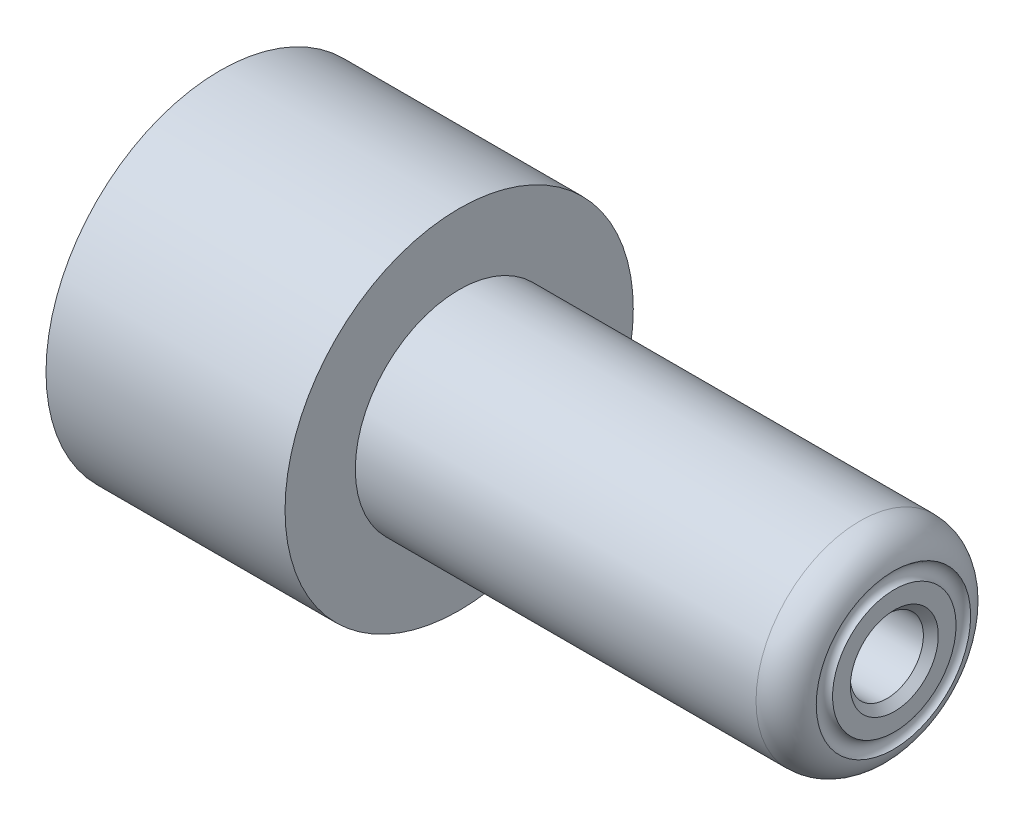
ISO-10303-21;
HEADER;
FILE_DESCRIPTION(('STEP AP214'),'2;1');
FILE_NAME('part.step','',(''),(''),'','','');
FILE_SCHEMA(('AUTOMOTIVE_DESIGN { 1 0 10303 214 1 1 1 1 }'));
ENDSEC;
DATA;
#1=APPLICATION_CONTEXT('core data for automotive mechanical design processes');
#2=APPLICATION_PROTOCOL_DEFINITION('international standard','automotive_design',2000,#1);
#3=PRODUCT_CONTEXT('',#1,'mechanical');
#4=PRODUCT('Part','Part','',(#3));
#5=PRODUCT_RELATED_PRODUCT_CATEGORY('part','',(#4));
#6=PRODUCT_DEFINITION_FORMATION('','',#4);
#7=PRODUCT_DEFINITION_CONTEXT('part definition',#1,'design');
#8=PRODUCT_DEFINITION('design','',#6,#7);
#9=PRODUCT_DEFINITION_SHAPE('','',#8);
#10=(LENGTH_UNIT() NAMED_UNIT(*) SI_UNIT(.MILLI.,.METRE.));
#11=(NAMED_UNIT(*) PLANE_ANGLE_UNIT() SI_UNIT($,.RADIAN.));
#12=(NAMED_UNIT(*) SI_UNIT($,.STERADIAN.) SOLID_ANGLE_UNIT());
#13=UNCERTAINTY_MEASURE_WITH_UNIT(LENGTH_MEASURE(1.E-05),#10,'distance_accuracy_value','');
#14=(GEOMETRIC_REPRESENTATION_CONTEXT(3) GLOBAL_UNCERTAINTY_ASSIGNED_CONTEXT((#13)) GLOBAL_UNIT_ASSIGNED_CONTEXT((#10,
#11,#12)) REPRESENTATION_CONTEXT('',''));
#15=CARTESIAN_POINT('',(0.,0.,0.));
#16=DIRECTION('',(0.,0.,1.));
#17=DIRECTION('',(1.,0.,0.));
#18=AXIS2_PLACEMENT_3D('',#15,#16,#17);
#19=CARTESIAN_POINT('',(30.734,3.165,0.));
#20=DIRECTION('',(-1.,0.,0.));
#21=DIRECTION('',(0.,0.,1.));
#22=AXIS2_PLACEMENT_3D('',#19,#20,#21);
#23=PLANE('',#22);
#24=CARTESIAN_POINT('',(30.734,0.,0.));
#25=DIRECTION('',(-1.,0.,0.));
#26=DIRECTION('',(0.,0.,1.));
#27=AXIS2_PLACEMENT_3D('',#24,#25,#26);
#28=CIRCLE('',#27,2.005);
#29=CARTESIAN_POINT('',(30.734,0.,2.005));
#30=VERTEX_POINT('',#29);
#31=EDGE_CURVE('E10',#30,#30,#28,.T.);
#32=ORIENTED_EDGE('',*,*,#31,.T.);
#33=EDGE_LOOP('',(#32));
#34=FACE_BOUND('',#33,.T.);
#35=CARTESIAN_POINT('',(30.734,0.,0.));
#36=DIRECTION('',(1.,0.,0.));
#37=DIRECTION('',(0.,0.,-1.));
#38=AXIS2_PLACEMENT_3D('',#35,#36,#37);
#39=CIRCLE('',#38,2.8144004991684);
#40=CARTESIAN_POINT('',(30.734,0.,-2.8144004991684));
#41=VERTEX_POINT('',#40);
#42=EDGE_CURVE('E78',#41,#41,#39,.F.);
#43=ORIENTED_EDGE('',*,*,#42,.F.);
#44=EDGE_LOOP('',(#43));
#45=FACE_BOUND('',#44,.T.);
#46=ADVANCED_FACE('F31',(#34,#45),#23,.F.);
#47=CARTESIAN_POINT('',(29.164,0.,0.));
#48=DIRECTION('',(-1.,0.,0.));
#49=DIRECTION('',(0.,0.,1.));
#50=AXIS2_PLACEMENT_3D('',#47,#48,#49);
#51=TOROIDAL_SURFACE('',#50,3.165,1.57);
#52=CARTESIAN_POINT('',(29.164,0.,0.));
#53=DIRECTION('',(-1.,0.,0.));
#54=DIRECTION('',(0.,0.,1.));
#55=AXIS2_PLACEMENT_3D('',#52,#53,#54);
#56=CIRCLE('',#55,4.735);
#57=CARTESIAN_POINT('',(29.164,0.,4.735));
#58=VERTEX_POINT('',#57);
#59=EDGE_CURVE('E48',#58,#58,#56,.T.);
#60=ORIENTED_EDGE('',*,*,#59,.F.);
#61=EDGE_LOOP('',(#60));
#62=FACE_BOUND('',#61,.T.);
#63=CARTESIAN_POINT('',(30.6935348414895,0.,0.));
#64=DIRECTION('',(1.,0.,0.));
#65=DIRECTION('',(0.,0.,-1.));
#66=AXIS2_PLACEMENT_3D('',#63,#64,#65);
#67=CIRCLE('',#66,3.51915133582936);
#68=CARTESIAN_POINT('',(30.6935348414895,0.,-3.51915133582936));
#69=VERTEX_POINT('',#68);
#70=EDGE_CURVE('E35',#69,#69,#67,.T.);
#71=ORIENTED_EDGE('',*,*,#70,.F.);
#72=EDGE_LOOP('',(#71));
#73=FACE_BOUND('',#72,.T.);
#74=ADVANCED_FACE('F87',(#62,#73),#51,.T.);
#75=CARTESIAN_POINT('',(0.,0.,0.));
#76=DIRECTION('',(-1.,0.,0.));
#77=DIRECTION('',(0.,0.,1.));
#78=AXIS2_PLACEMENT_3D('',#75,#76,#77);
#79=CYLINDRICAL_SURFACE('',#78,3.57);
#80=CARTESIAN_POINT('',(24.4856,0.,0.));
#81=DIRECTION('',(-1.,0.,0.));
#82=DIRECTION('',(0.,0.,1.));
#83=AXIS2_PLACEMENT_3D('',#80,#81,#82);
#84=CIRCLE('',#83,3.57);
#85=CARTESIAN_POINT('',(24.4856,0.,3.57));
#86=VERTEX_POINT('',#85);
#87=EDGE_CURVE('E43',#86,#86,#84,.T.);
#88=ORIENTED_EDGE('',*,*,#87,.F.);
#89=EDGE_LOOP('',(#88));
#90=FACE_BOUND('',#89,.T.);
#91=CARTESIAN_POINT('',(0.,0.,0.));
#92=DIRECTION('',(-1.,0.,0.));
#93=DIRECTION('',(0.,0.,1.));
#94=AXIS2_PLACEMENT_3D('',#91,#92,#93);
#95=CIRCLE('',#94,3.57);
#96=CARTESIAN_POINT('',(0.,0.,3.57));
#97=VERTEX_POINT('',#96);
#98=EDGE_CURVE('E60',#97,#97,#95,.T.);
#99=ORIENTED_EDGE('',*,*,#98,.T.);
#100=EDGE_LOOP('',(#99));
#101=FACE_BOUND('',#100,.T.);
#102=ADVANCED_FACE('F89',(#90,#101),#79,.F.);
#103=CARTESIAN_POINT('',(24.4856,3.57,0.));
#104=DIRECTION('',(1.,0.,0.));
#105=DIRECTION('',(0.,0.,-1.));
#106=AXIS2_PLACEMENT_3D('',#103,#104,#105);
#107=PLANE('',#106);
#108=CARTESIAN_POINT('',(24.4856,0.,0.));
#109=DIRECTION('',(1.,0.,0.));
#110=DIRECTION('',(0.,0.,-1.));
#111=AXIS2_PLACEMENT_3D('',#108,#109,#110);
#112=CIRCLE('',#111,1.665);
#113=CARTESIAN_POINT('',(24.4856,0.,-1.665));
#114=VERTEX_POINT('',#113);
#115=EDGE_CURVE('E73',#114,#114,#112,.T.);
#116=ORIENTED_EDGE('',*,*,#115,.T.);
#117=EDGE_LOOP('',(#116));
#118=FACE_BOUND('',#117,.T.);
#119=ORIENTED_EDGE('',*,*,#87,.T.);
#120=EDGE_LOOP('',(#119));
#121=FACE_BOUND('',#120,.T.);
#122=ADVANCED_FACE('F96',(#118,#121),#107,.F.);
#123=CARTESIAN_POINT('',(0.,0.,0.));
#124=DIRECTION('',(-1.,0.,0.));
#125=DIRECTION('',(0.,0.,1.));
#126=AXIS2_PLACEMENT_3D('',#123,#124,#125);
#127=CYLINDRICAL_SURFACE('',#126,4.735);
#128=CARTESIAN_POINT('',(10.8966,0.,0.));
#129=DIRECTION('',(-1.,0.,0.));
#130=DIRECTION('',(0.,0.,1.));
#131=AXIS2_PLACEMENT_3D('',#128,#129,#130);
#132=CIRCLE('',#131,4.735);
#133=CARTESIAN_POINT('',(10.8966,0.,4.735));
#134=VERTEX_POINT('',#133);
#135=EDGE_CURVE('E51',#134,#134,#132,.T.);
#136=ORIENTED_EDGE('',*,*,#135,.F.);
#137=EDGE_LOOP('',(#136));
#138=FACE_BOUND('',#137,.T.);
#139=ORIENTED_EDGE('',*,*,#59,.T.);
#140=EDGE_LOOP('',(#139));
#141=FACE_BOUND('',#140,.T.);
#142=ADVANCED_FACE('F101',(#138,#141),#127,.T.);
#143=CARTESIAN_POINT('',(10.8966,7.9375,0.));
#144=DIRECTION('',(-1.,0.,0.));
#145=DIRECTION('',(0.,0.,1.));
#146=AXIS2_PLACEMENT_3D('',#143,#144,#145);
#147=PLANE('',#146);
#148=CARTESIAN_POINT('',(10.8966,0.,0.));
#149=DIRECTION('',(-1.,0.,0.));
#150=DIRECTION('',(0.,0.,1.));
#151=AXIS2_PLACEMENT_3D('',#148,#149,#150);
#152=CIRCLE('',#151,7.9375);
#153=CARTESIAN_POINT('',(10.8966,0.,7.9375));
#154=VERTEX_POINT('',#153);
#155=EDGE_CURVE('E54',#154,#154,#152,.T.);
#156=ORIENTED_EDGE('',*,*,#155,.F.);
#157=EDGE_LOOP('',(#156));
#158=FACE_BOUND('',#157,.T.);
#159=ORIENTED_EDGE('',*,*,#135,.T.);
#160=EDGE_LOOP('',(#159));
#161=FACE_BOUND('',#160,.T.);
#162=ADVANCED_FACE('F109',(#158,#161),#147,.F.);
#163=CARTESIAN_POINT('',(0.,0.,0.));
#164=DIRECTION('',(-1.,0.,0.));
#165=DIRECTION('',(0.,0.,1.));
#166=AXIS2_PLACEMENT_3D('',#163,#164,#165);
#167=CYLINDRICAL_SURFACE('',#166,7.9375);
#168=CARTESIAN_POINT('',(0.,0.,0.));
#169=DIRECTION('',(-1.,0.,0.));
#170=DIRECTION('',(0.,0.,1.));
#171=AXIS2_PLACEMENT_3D('',#168,#169,#170);
#172=CIRCLE('',#171,7.9375);
#173=CARTESIAN_POINT('',(0.,0.,7.9375));
#174=VERTEX_POINT('',#173);
#175=EDGE_CURVE('E57',#174,#174,#172,.T.);
#176=ORIENTED_EDGE('',*,*,#175,.F.);
#177=EDGE_LOOP('',(#176));
#178=FACE_BOUND('',#177,.T.);
#179=ORIENTED_EDGE('',*,*,#155,.T.);
#180=EDGE_LOOP('',(#179));
#181=FACE_BOUND('',#180,.T.);
#182=ADVANCED_FACE('F121',(#178,#181),#167,.T.);
#183=CARTESIAN_POINT('',(0.,3.57,0.));
#184=DIRECTION('',(1.,0.,0.));
#185=DIRECTION('',(0.,0.,-1.));
#186=AXIS2_PLACEMENT_3D('',#183,#184,#185);
#187=PLANE('',#186);
#188=CARTESIAN_POINT('',(0.,0.,5.5499));
#189=DIRECTION('',(-1.,0.,0.));
#190=DIRECTION('',(0.,0.,-1.));
#191=AXIS2_PLACEMENT_3D('',#188,#189,#190);
#192=CIRCLE('',#191,1.18);
#193=CARTESIAN_POINT('',(0.,0.,4.3699));
#194=VERTEX_POINT('',#193);
#195=EDGE_CURVE('E70',#194,#194,#192,.T.);
#196=ORIENTED_EDGE('',*,*,#195,.F.);
#197=EDGE_LOOP('',(#196));
#198=FACE_BOUND('',#197,.T.);
#199=CARTESIAN_POINT('',(0.,0.,-5.5499));
#200=DIRECTION('',(-1.,0.,0.));
#201=DIRECTION('',(0.,0.,1.));
#202=AXIS2_PLACEMENT_3D('',#199,#200,#201);
#203=CIRCLE('',#202,1.18);
#204=CARTESIAN_POINT('',(0.,0.,-4.3699));
#205=VERTEX_POINT('',#204);
#206=EDGE_CURVE('E64',#205,#205,#203,.T.);
#207=ORIENTED_EDGE('',*,*,#206,.F.);
#208=EDGE_LOOP('',(#207));
#209=FACE_BOUND('',#208,.T.);
#210=ORIENTED_EDGE('',*,*,#98,.F.);
#211=EDGE_LOOP('',(#210));
#212=FACE_BOUND('',#211,.T.);
#213=ORIENTED_EDGE('',*,*,#175,.T.);
#214=EDGE_LOOP('',(#213));
#215=FACE_BOUND('',#214,.T.);
#216=ADVANCED_FACE('F117',(#198,#209,#212,#215),#187,.F.);
#217=CARTESIAN_POINT('',(2.36,0.,-5.5499));
#218=DIRECTION('',(-1.,0.,0.));
#219=DIRECTION('',(0.,0.,1.));
#220=AXIS2_PLACEMENT_3D('',#217,#218,#219);
#221=CYLINDRICAL_SURFACE('',#220,1.18);
#222=CARTESIAN_POINT('',(2.36,0.,-5.5499));
#223=DIRECTION('',(-1.,0.,0.));
#224=DIRECTION('',(0.,0.,1.));
#225=AXIS2_PLACEMENT_3D('',#222,#223,#224);
#226=CIRCLE('',#225,1.18);
#227=CARTESIAN_POINT('',(2.36,0.,-4.3699));
#228=VERTEX_POINT('',#227);
#229=EDGE_CURVE('E63',#228,#228,#226,.T.);
#230=ORIENTED_EDGE('',*,*,#229,.F.);
#231=EDGE_LOOP('',(#230));
#232=FACE_BOUND('',#231,.T.);
#233=ORIENTED_EDGE('',*,*,#206,.T.);
#234=EDGE_LOOP('',(#233));
#235=FACE_BOUND('',#234,.T.);
#236=ADVANCED_FACE('F120',(#232,#235),#221,.F.);
#237=CARTESIAN_POINT('',(2.36,0.,-5.5499));
#238=DIRECTION('',(-1.,0.,0.));
#239=DIRECTION('',(0.,0.,1.));
#240=AXIS2_PLACEMENT_3D('',#237,#238,#239);
#241=PLANE('',#240);
#242=ORIENTED_EDGE('',*,*,#229,.T.);
#243=EDGE_LOOP('',(#242));
#244=FACE_BOUND('',#243,.T.);
#245=ADVANCED_FACE('F140',(#244),#241,.T.);
#246=CARTESIAN_POINT('',(2.36,0.,5.5499));
#247=DIRECTION('',(-1.,0.,0.));
#248=DIRECTION('',(0.,0.,1.));
#249=AXIS2_PLACEMENT_3D('',#246,#247,#248);
#250=CYLINDRICAL_SURFACE('',#249,1.18);
#251=CARTESIAN_POINT('',(2.36,0.,5.5499));
#252=DIRECTION('',(-1.,0.,0.));
#253=DIRECTION('',(0.,0.,-1.));
#254=AXIS2_PLACEMENT_3D('',#251,#252,#253);
#255=CIRCLE('',#254,1.18);
#256=CARTESIAN_POINT('',(2.36,0.,4.3699));
#257=VERTEX_POINT('',#256);
#258=EDGE_CURVE('E67',#257,#257,#255,.T.);
#259=ORIENTED_EDGE('',*,*,#258,.F.);
#260=EDGE_LOOP('',(#259));
#261=FACE_BOUND('',#260,.T.);
#262=ORIENTED_EDGE('',*,*,#195,.T.);
#263=EDGE_LOOP('',(#262));
#264=FACE_BOUND('',#263,.T.);
#265=ADVANCED_FACE('F144',(#261,#264),#250,.F.);
#266=CARTESIAN_POINT('',(2.36,0.,5.5499));
#267=DIRECTION('',(1.,0.,0.));
#268=DIRECTION('',(0.,0.,-1.));
#269=AXIS2_PLACEMENT_3D('',#266,#267,#268);
#270=PLANE('',#269);
#271=ORIENTED_EDGE('',*,*,#258,.T.);
#272=EDGE_LOOP('',(#271));
#273=FACE_BOUND('',#272,.T.);
#274=ADVANCED_FACE('F148',(#273),#270,.F.);
#275=CARTESIAN_POINT('',(0.,0.,0.));
#276=DIRECTION('',(1.,0.,0.));
#277=DIRECTION('',(0.,0.,-1.));
#278=AXIS2_PLACEMENT_3D('',#275,#276,#277);
#279=CYLINDRICAL_SURFACE('',#278,1.665);
#280=CARTESIAN_POINT('',(30.394,0.,0.));
#281=DIRECTION('',(-1.,0.,0.));
#282=DIRECTION('',(0.,0.,1.));
#283=AXIS2_PLACEMENT_3D('',#280,#281,#282);
#284=CIRCLE('',#283,1.665);
#285=CARTESIAN_POINT('',(30.394,0.,1.665));
#286=VERTEX_POINT('',#285);
#287=EDGE_CURVE('E39',#286,#286,#284,.F.);
#288=ORIENTED_EDGE('',*,*,#287,.T.);
#289=EDGE_LOOP('',(#288));
#290=FACE_BOUND('',#289,.T.);
#291=ORIENTED_EDGE('',*,*,#115,.F.);
#292=EDGE_LOOP('',(#291));
#293=FACE_BOUND('',#292,.T.);
#294=ADVANCED_FACE('F152',(#290,#293),#279,.F.);
#295=CARTESIAN_POINT('',(30.394,0.,0.));
#296=DIRECTION('',(1.,0.,0.));
#297=DIRECTION('',(0.,0.,-1.));
#298=AXIS2_PLACEMENT_3D('',#295,#296,#297);
#299=CONICAL_SURFACE('',#298,1.665,0.785398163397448);
#300=ORIENTED_EDGE('',*,*,#31,.F.);
#301=EDGE_LOOP('',(#300));
#302=FACE_BOUND('',#301,.T.);
#303=ORIENTED_EDGE('',*,*,#287,.F.);
#304=EDGE_LOOP('',(#303));
#305=FACE_BOUND('',#304,.T.);
#306=ADVANCED_FACE('F33',(#302,#305),#299,.F.);
#307=CARTESIAN_POINT('',(30.857,0.,0.));
#308=DIRECTION('',(-1.,0.,0.));
#309=DIRECTION('',(0.,0.,1.));
#310=AXIS2_PLACEMENT_3D('',#307,#308,#309);
#311=TOROIDAL_SURFACE('',#310,3.175,0.380999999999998);
#312=ORIENTED_EDGE('',*,*,#70,.T.);
#313=EDGE_LOOP('',(#312));
#314=FACE_BOUND('',#313,.T.);
#315=ORIENTED_EDGE('',*,*,#42,.T.);
#316=EDGE_LOOP('',(#315));
#317=FACE_BOUND('',#316,.T.);
#318=ADVANCED_FACE('F85',(#314,#317),#311,.F.);
#319=CLOSED_SHELL('',(#46,#74,#102,#122,#142,#162,#182,#216,#236,#245,#265,#274,#294,#306,#318));
#320=MANIFOLD_SOLID_BREP('B2',#319);
#321=ADVANCED_BREP_SHAPE_REPRESENTATION('',(#18,#320),#14);
#322=SHAPE_DEFINITION_REPRESENTATION(#9,#321);
ENDSEC;
END-ISO-10303-21;
